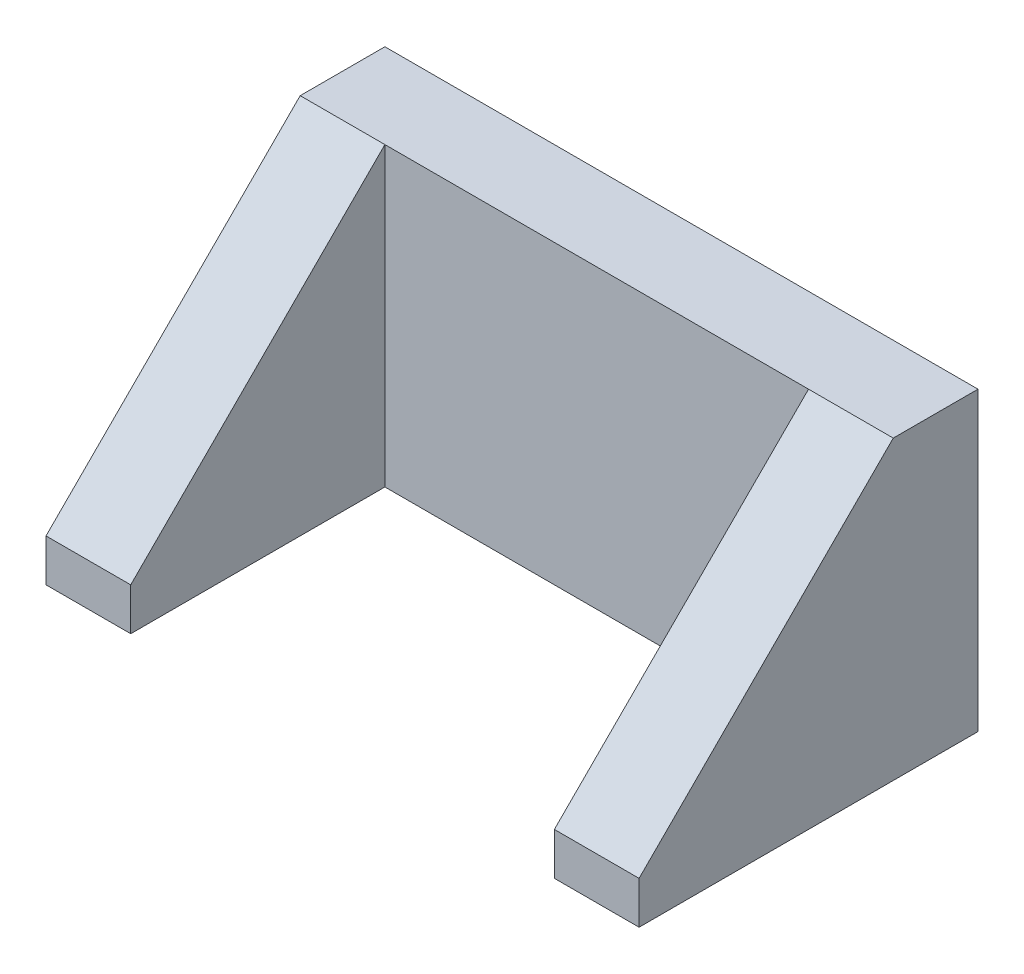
ISO-10303-21;
HEADER;
FILE_DESCRIPTION(('STEP AP214'),'2;1');
FILE_NAME('part.step','',(''),(''),'','','');
FILE_SCHEMA(('AUTOMOTIVE_DESIGN { 1 0 10303 214 1 1 1 1 }'));
ENDSEC;
DATA;
#1=APPLICATION_CONTEXT('core data for automotive mechanical design processes');
#2=APPLICATION_PROTOCOL_DEFINITION('international standard','automotive_design',2000,#1);
#3=PRODUCT_CONTEXT('',#1,'mechanical');
#4=PRODUCT('Part','Part','',(#3));
#5=PRODUCT_RELATED_PRODUCT_CATEGORY('part','',(#4));
#6=PRODUCT_DEFINITION_FORMATION('','',#4);
#7=PRODUCT_DEFINITION_CONTEXT('part definition',#1,'design');
#8=PRODUCT_DEFINITION('design','',#6,#7);
#9=PRODUCT_DEFINITION_SHAPE('','',#8);
#10=(LENGTH_UNIT() NAMED_UNIT(*) SI_UNIT(.MILLI.,.METRE.));
#11=(NAMED_UNIT(*) PLANE_ANGLE_UNIT() SI_UNIT($,.RADIAN.));
#12=(NAMED_UNIT(*) SI_UNIT($,.STERADIAN.) SOLID_ANGLE_UNIT());
#13=UNCERTAINTY_MEASURE_WITH_UNIT(LENGTH_MEASURE(1.E-05),#10,'distance_accuracy_value','');
#14=(GEOMETRIC_REPRESENTATION_CONTEXT(3) GLOBAL_UNCERTAINTY_ASSIGNED_CONTEXT((#13)) GLOBAL_UNIT_ASSIGNED_CONTEXT((#10,
#11,#12)) REPRESENTATION_CONTEXT('',''));
#15=CARTESIAN_POINT('',(0.,0.,0.));
#16=DIRECTION('',(0.,0.,1.));
#17=DIRECTION('',(1.,0.,0.));
#18=AXIS2_PLACEMENT_3D('',#15,#16,#17);
#19=CARTESIAN_POINT('',(25.4,12.7,-152.4));
#20=DIRECTION('',(0.,0.,-1.));
#21=DIRECTION('',(-1.,0.,0.));
#22=AXIS2_PLACEMENT_3D('',#19,#20,#21);
#23=PLANE('',#22);
#24=DIRECTION('',(1.,0.,0.));
#25=VECTOR('',#24,1.);
#26=CARTESIAN_POINT('',(0.,88.9,-152.4));
#27=LINE('',#26,#25);
#28=CARTESIAN_POINT('',(25.4000000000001,88.9,-152.4));
#29=VERTEX_POINT('',#28);
#30=CARTESIAN_POINT('',(152.4,88.9,-152.4));
#31=VERTEX_POINT('',#30);
#32=EDGE_CURVE('E168',#29,#31,#27,.T.);
#33=ORIENTED_EDGE('',*,*,#32,.F.);
#34=DIRECTION('',(0.,-1.,0.));
#35=VECTOR('',#34,1.);
#36=CARTESIAN_POINT('',(25.4,12.7,-152.4));
#37=LINE('',#36,#35);
#38=CARTESIAN_POINT('',(25.4,0.,-152.4));
#39=VERTEX_POINT('',#38);
#40=EDGE_CURVE('E11',#29,#39,#37,.T.);
#41=ORIENTED_EDGE('',*,*,#40,.T.);
#42=DIRECTION('',(1.,0.,0.));
#43=VECTOR('',#42,1.);
#44=CARTESIAN_POINT('',(25.4,0.,-152.4));
#45=LINE('',#44,#43);
#46=CARTESIAN_POINT('',(152.4,0.,-152.4));
#47=VERTEX_POINT('',#46);
#48=EDGE_CURVE('E184',#39,#47,#45,.T.);
#49=ORIENTED_EDGE('',*,*,#48,.T.);
#50=DIRECTION('',(0.,-1.,0.));
#51=VECTOR('',#50,1.);
#52=CARTESIAN_POINT('',(152.4,12.7,-152.4));
#53=LINE('',#52,#51);
#54=EDGE_CURVE('E54',#31,#47,#53,.T.);
#55=ORIENTED_EDGE('',*,*,#54,.F.);
#56=EDGE_LOOP('',(#33,#41,#49,#55));
#57=FACE_BOUND('',#56,.T.);
#58=ADVANCED_FACE('F45',(#57),#23,.F.);
#59=CARTESIAN_POINT('',(0.,12.7,-177.8));
#60=DIRECTION('',(1.,0.,0.));
#61=DIRECTION('',(0.,0.,-1.));
#62=AXIS2_PLACEMENT_3D('',#59,#60,#61);
#63=PLANE('',#62);
#64=DIRECTION('',(0.,0.,1.));
#65=VECTOR('',#64,1.);
#66=CARTESIAN_POINT('',(0.,0.,-177.8));
#67=LINE('',#66,#65);
#68=CARTESIAN_POINT('',(0.,0.,-177.8));
#69=VERTEX_POINT('',#68);
#70=CARTESIAN_POINT('',(0.,0.,-76.1999999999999));
#71=VERTEX_POINT('',#70);
#72=EDGE_CURVE('E132',#69,#71,#67,.T.);
#73=ORIENTED_EDGE('',*,*,#72,.T.);
#74=DIRECTION('',(0.,1.,0.));
#75=VECTOR('',#74,1.);
#76=CARTESIAN_POINT('',(0.,-63.5,-76.1999999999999));
#77=LINE('',#76,#75);
#78=CARTESIAN_POINT('',(0.,12.7,-76.1999999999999));
#79=VERTEX_POINT('',#78);
#80=EDGE_CURVE('E119',#71,#79,#77,.T.);
#81=ORIENTED_EDGE('',*,*,#80,.T.);
#82=DIRECTION('',(0.,-0.707106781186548,0.707106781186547));
#83=VECTOR('',#82,1.);
#84=CARTESIAN_POINT('',(0.,12.7,-76.1999999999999));
#85=LINE('',#84,#83);
#86=CARTESIAN_POINT('',(0.,88.9,-152.4));
#87=VERTEX_POINT('',#86);
#88=EDGE_CURVE('E127',#87,#79,#85,.T.);
#89=ORIENTED_EDGE('',*,*,#88,.F.);
#90=DIRECTION('',(0.,0.,1.));
#91=VECTOR('',#90,1.);
#92=CARTESIAN_POINT('',(0.,88.9,-177.8));
#93=LINE('',#92,#91);
#94=CARTESIAN_POINT('',(0.,88.9,-177.8));
#95=VERTEX_POINT('',#94);
#96=EDGE_CURVE('E153',#95,#87,#93,.T.);
#97=ORIENTED_EDGE('',*,*,#96,.F.);
#98=DIRECTION('',(0.,-1.,0.));
#99=VECTOR('',#98,1.);
#100=CARTESIAN_POINT('',(0.,12.7,-177.8));
#101=LINE('',#100,#99);
#102=EDGE_CURVE('E67',#95,#69,#101,.T.);
#103=ORIENTED_EDGE('',*,*,#102,.T.);
#104=EDGE_LOOP('',(#73,#81,#89,#97,#103));
#105=FACE_BOUND('',#104,.T.);
#106=ADVANCED_FACE('F47',(#105),#63,.F.);
#107=CARTESIAN_POINT('',(25.4,12.7,0.));
#108=DIRECTION('',(-1.,0.,0.));
#109=DIRECTION('',(0.,0.,1.));
#110=AXIS2_PLACEMENT_3D('',#107,#108,#109);
#111=PLANE('',#110);
#112=DIRECTION('',(0.,0.707106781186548,-0.707106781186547));
#113=VECTOR('',#112,1.);
#114=CARTESIAN_POINT('',(25.4000000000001,12.7,-76.1999999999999));
#115=LINE('',#114,#113);
#116=CARTESIAN_POINT('',(25.4000000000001,12.7,-76.1999999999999));
#117=VERTEX_POINT('',#116);
#118=EDGE_CURVE('E126',#117,#29,#115,.T.);
#119=ORIENTED_EDGE('',*,*,#118,.F.);
#120=DIRECTION('',(0.,-1.,0.));
#121=VECTOR('',#120,1.);
#122=CARTESIAN_POINT('',(25.4,12.7,-76.1999999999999));
#123=LINE('',#122,#121);
#124=CARTESIAN_POINT('',(25.4,0.,-76.1999999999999));
#125=VERTEX_POINT('',#124);
#126=EDGE_CURVE('E122',#117,#125,#123,.T.);
#127=ORIENTED_EDGE('',*,*,#126,.T.);
#128=DIRECTION('',(0.,0.,-1.));
#129=VECTOR('',#128,1.);
#130=CARTESIAN_POINT('',(25.4,0.,0.));
#131=LINE('',#130,#129);
#132=EDGE_CURVE('E181',#125,#39,#131,.T.);
#133=ORIENTED_EDGE('',*,*,#132,.T.);
#134=ORIENTED_EDGE('',*,*,#40,.F.);
#135=EDGE_LOOP('',(#119,#127,#133,#134));
#136=FACE_BOUND('',#135,.T.);
#137=ADVANCED_FACE('F227',(#136),#111,.F.);
#138=CARTESIAN_POINT('',(152.4,12.7,-152.4));
#139=DIRECTION('',(1.,0.,0.));
#140=DIRECTION('',(0.,0.,-1.));
#141=AXIS2_PLACEMENT_3D('',#138,#139,#140);
#142=PLANE('',#141);
#143=DIRECTION('',(0.,0.,1.));
#144=VECTOR('',#143,1.);
#145=CARTESIAN_POINT('',(152.4,0.,-152.4));
#146=LINE('',#145,#144);
#147=CARTESIAN_POINT('',(152.4,0.,-76.1999999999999));
#148=VERTEX_POINT('',#147);
#149=EDGE_CURVE('E188',#47,#148,#146,.T.);
#150=ORIENTED_EDGE('',*,*,#149,.T.);
#151=DIRECTION('',(0.,1.,0.));
#152=VECTOR('',#151,1.);
#153=CARTESIAN_POINT('',(152.4,12.7,-76.1999999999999));
#154=LINE('',#153,#152);
#155=CARTESIAN_POINT('',(152.4,12.7,-76.1999999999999));
#156=VERTEX_POINT('',#155);
#157=EDGE_CURVE('E141',#148,#156,#154,.T.);
#158=ORIENTED_EDGE('',*,*,#157,.T.);
#159=DIRECTION('',(0.,0.707106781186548,-0.707106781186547));
#160=VECTOR('',#159,1.);
#161=CARTESIAN_POINT('',(152.4,12.7,-76.1999999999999));
#162=LINE('',#161,#160);
#163=EDGE_CURVE('E149',#156,#31,#162,.T.);
#164=ORIENTED_EDGE('',*,*,#163,.T.);
#165=ORIENTED_EDGE('',*,*,#54,.T.);
#166=EDGE_LOOP('',(#150,#158,#164,#165));
#167=FACE_BOUND('',#166,.T.);
#168=ADVANCED_FACE('F206',(#167),#142,.F.);
#169=CARTESIAN_POINT('',(177.8,12.7,0.));
#170=DIRECTION('',(-1.,0.,0.));
#171=DIRECTION('',(0.,0.,1.));
#172=AXIS2_PLACEMENT_3D('',#169,#170,#171);
#173=PLANE('',#172);
#174=DIRECTION('',(0.,-0.707106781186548,0.707106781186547));
#175=VECTOR('',#174,1.);
#176=CARTESIAN_POINT('',(177.8,12.7,-76.1999999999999));
#177=LINE('',#176,#175);
#178=CARTESIAN_POINT('',(177.8,88.9,-152.4));
#179=VERTEX_POINT('',#178);
#180=CARTESIAN_POINT('',(177.8,12.7,-76.1999999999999));
#181=VERTEX_POINT('',#180);
#182=EDGE_CURVE('E155',#179,#181,#177,.T.);
#183=ORIENTED_EDGE('',*,*,#182,.T.);
#184=DIRECTION('',(0.,1.,0.));
#185=VECTOR('',#184,1.);
#186=CARTESIAN_POINT('',(177.8,-63.5,-76.1999999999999));
#187=LINE('',#186,#185);
#188=CARTESIAN_POINT('',(177.8,0.,-76.1999999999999));
#189=VERTEX_POINT('',#188);
#190=EDGE_CURVE('E135',#189,#181,#187,.T.);
#191=ORIENTED_EDGE('',*,*,#190,.F.);
#192=DIRECTION('',(0.,0.,-1.));
#193=VECTOR('',#192,1.);
#194=CARTESIAN_POINT('',(177.8,0.,0.));
#195=LINE('',#194,#193);
#196=CARTESIAN_POINT('',(177.8,0.,-177.8));
#197=VERTEX_POINT('',#196);
#198=EDGE_CURVE('E192',#189,#197,#195,.T.);
#199=ORIENTED_EDGE('',*,*,#198,.T.);
#200=DIRECTION('',(0.,-1.,0.));
#201=VECTOR('',#200,1.);
#202=CARTESIAN_POINT('',(177.8,12.7,-177.8));
#203=LINE('',#202,#201);
#204=CARTESIAN_POINT('',(177.8,88.9,-177.8));
#205=VERTEX_POINT('',#204);
#206=EDGE_CURVE('E200',#205,#197,#203,.T.);
#207=ORIENTED_EDGE('',*,*,#206,.F.);
#208=DIRECTION('',(0.,0.,-1.));
#209=VECTOR('',#208,1.);
#210=CARTESIAN_POINT('',(177.8,88.9,-177.8));
#211=LINE('',#210,#209);
#212=EDGE_CURVE('E171',#179,#205,#211,.T.);
#213=ORIENTED_EDGE('',*,*,#212,.F.);
#214=EDGE_LOOP('',(#183,#191,#199,#207,#213));
#215=FACE_BOUND('',#214,.T.);
#216=ADVANCED_FACE('F237',(#215),#173,.F.);
#217=CARTESIAN_POINT('',(177.8,12.7,-177.8));
#218=DIRECTION('',(0.,0.,1.));
#219=DIRECTION('',(1.,0.,0.));
#220=AXIS2_PLACEMENT_3D('',#217,#218,#219);
#221=PLANE('',#220);
#222=ORIENTED_EDGE('',*,*,#206,.T.);
#223=DIRECTION('',(-1.,0.,0.));
#224=VECTOR('',#223,1.);
#225=CARTESIAN_POINT('',(177.8,0.,-177.8));
#226=LINE('',#225,#224);
#227=EDGE_CURVE('E195',#197,#69,#226,.T.);
#228=ORIENTED_EDGE('',*,*,#227,.T.);
#229=ORIENTED_EDGE('',*,*,#102,.F.);
#230=DIRECTION('',(-1.,0.,0.));
#231=VECTOR('',#230,1.);
#232=CARTESIAN_POINT('',(0.,88.9,-177.8));
#233=LINE('',#232,#231);
#234=EDGE_CURVE('E175',#205,#95,#233,.T.);
#235=ORIENTED_EDGE('',*,*,#234,.F.);
#236=EDGE_LOOP('',(#222,#228,#229,#235));
#237=FACE_BOUND('',#236,.T.);
#238=ADVANCED_FACE('F235',(#237),#221,.F.);
#239=CARTESIAN_POINT('',(0.,0.,0.));
#240=DIRECTION('',(0.,1.,0.));
#241=DIRECTION('',(0.,0.,1.));
#242=AXIS2_PLACEMENT_3D('',#239,#240,#241);
#243=PLANE('',#242);
#244=ORIENTED_EDGE('',*,*,#198,.F.);
#245=DIRECTION('',(-1.,0.,0.));
#246=VECTOR('',#245,1.);
#247=CARTESIAN_POINT('',(0.,0.,-76.1999999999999));
#248=LINE('',#247,#246);
#249=EDGE_CURVE('E145',#189,#148,#248,.T.);
#250=ORIENTED_EDGE('',*,*,#249,.T.);
#251=ORIENTED_EDGE('',*,*,#149,.F.);
#252=ORIENTED_EDGE('',*,*,#48,.F.);
#253=ORIENTED_EDGE('',*,*,#132,.F.);
#254=EDGE_CURVE('E134',#125,#71,#248,.T.);
#255=ORIENTED_EDGE('',*,*,#254,.T.);
#256=ORIENTED_EDGE('',*,*,#72,.F.);
#257=ORIENTED_EDGE('',*,*,#227,.F.);
#258=EDGE_LOOP('',(#244,#250,#251,#252,#253,#255,#256,#257));
#259=FACE_BOUND('',#258,.T.);
#260=ADVANCED_FACE('F217',(#259),#243,.F.);
#261=CARTESIAN_POINT('',(0.,88.9,0.));
#262=DIRECTION('',(0.,1.,0.));
#263=DIRECTION('',(0.,0.,1.));
#264=AXIS2_PLACEMENT_3D('',#261,#262,#263);
#265=PLANE('',#264);
#266=ORIENTED_EDGE('',*,*,#96,.T.);
#267=EDGE_CURVE('E139',#87,#29,#27,.T.);
#268=ORIENTED_EDGE('',*,*,#267,.T.);
#269=ORIENTED_EDGE('',*,*,#32,.T.);
#270=DIRECTION('',(1.,0.,0.));
#271=VECTOR('',#270,1.);
#272=CARTESIAN_POINT('',(44.6369265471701,88.9,-152.4));
#273=LINE('',#272,#271);
#274=EDGE_CURVE('E154',#31,#179,#273,.T.);
#275=ORIENTED_EDGE('',*,*,#274,.T.);
#276=ORIENTED_EDGE('',*,*,#212,.T.);
#277=ORIENTED_EDGE('',*,*,#234,.T.);
#278=EDGE_LOOP('',(#266,#268,#269,#275,#276,#277));
#279=FACE_BOUND('',#278,.T.);
#280=ADVANCED_FACE('F231',(#279),#265,.T.);
#281=CARTESIAN_POINT('',(44.6369265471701,12.7,-76.1999999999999));
#282=DIRECTION('',(0.,0.707106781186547,0.707106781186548));
#283=DIRECTION('',(0.,-0.707106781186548,0.707106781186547));
#284=AXIS2_PLACEMENT_3D('',#281,#282,#283);
#285=PLANE('',#284);
#286=ORIENTED_EDGE('',*,*,#163,.F.);
#287=DIRECTION('',(1.,0.,0.));
#288=VECTOR('',#287,1.);
#289=CARTESIAN_POINT('',(44.6369265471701,12.7,-76.1999999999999));
#290=LINE('',#289,#288);
#291=EDGE_CURVE('E159',#156,#181,#290,.T.);
#292=ORIENTED_EDGE('',*,*,#291,.T.);
#293=ORIENTED_EDGE('',*,*,#182,.F.);
#294=ORIENTED_EDGE('',*,*,#274,.F.);
#295=EDGE_LOOP('',(#286,#292,#293,#294));
#296=FACE_BOUND('',#295,.T.);
#297=ADVANCED_FACE('F241',(#296),#285,.T.);
#298=CARTESIAN_POINT('',(260.16307345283,12.7,-76.1999999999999));
#299=DIRECTION('',(0.,-0.707106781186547,-0.707106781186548));
#300=DIRECTION('',(0.,0.707106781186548,-0.707106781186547));
#301=AXIS2_PLACEMENT_3D('',#298,#299,#300);
#302=PLANE('',#301);
#303=DIRECTION('',(-1.,0.,0.));
#304=VECTOR('',#303,1.);
#305=CARTESIAN_POINT('',(260.16307345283,12.7,-76.1999999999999));
#306=LINE('',#305,#304);
#307=EDGE_CURVE('E116',#117,#79,#306,.T.);
#308=ORIENTED_EDGE('',*,*,#307,.F.);
#309=ORIENTED_EDGE('',*,*,#118,.T.);
#310=ORIENTED_EDGE('',*,*,#267,.F.);
#311=ORIENTED_EDGE('',*,*,#88,.T.);
#312=EDGE_LOOP('',(#308,#309,#310,#311));
#313=FACE_BOUND('',#312,.T.);
#314=ADVANCED_FACE('F137',(#313),#302,.F.);
#315=CARTESIAN_POINT('',(0.,-63.5,-76.1999999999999));
#316=DIRECTION('',(0.,0.,-1.));
#317=DIRECTION('',(-1.,0.,0.));
#318=AXIS2_PLACEMENT_3D('',#315,#316,#317);
#319=PLANE('',#318);
#320=ORIENTED_EDGE('',*,*,#307,.T.);
#321=ORIENTED_EDGE('',*,*,#80,.F.);
#322=ORIENTED_EDGE('',*,*,#254,.F.);
#323=ORIENTED_EDGE('',*,*,#126,.F.);
#324=EDGE_LOOP('',(#320,#321,#322,#323));
#325=FACE_BOUND('',#324,.T.);
#326=ADVANCED_FACE('F118',(#325),#319,.F.);
#327=ORIENTED_EDGE('',*,*,#249,.F.);
#328=ORIENTED_EDGE('',*,*,#190,.T.);
#329=ORIENTED_EDGE('',*,*,#291,.F.);
#330=ORIENTED_EDGE('',*,*,#157,.F.);
#331=EDGE_LOOP('',(#327,#328,#329,#330));
#332=FACE_BOUND('',#331,.T.);
#333=ADVANCED_FACE('F239',(#332),#319,.F.);
#334=CLOSED_SHELL('',(#58,#106,#137,#168,#216,#238,#260,#280,#297,#314,#326,#333));
#335=MANIFOLD_SOLID_BREP('B2',#334);
#336=ADVANCED_BREP_SHAPE_REPRESENTATION('',(#18,#335),#14);
#337=SHAPE_DEFINITION_REPRESENTATION(#9,#336);
ENDSEC;
END-ISO-10303-21;
